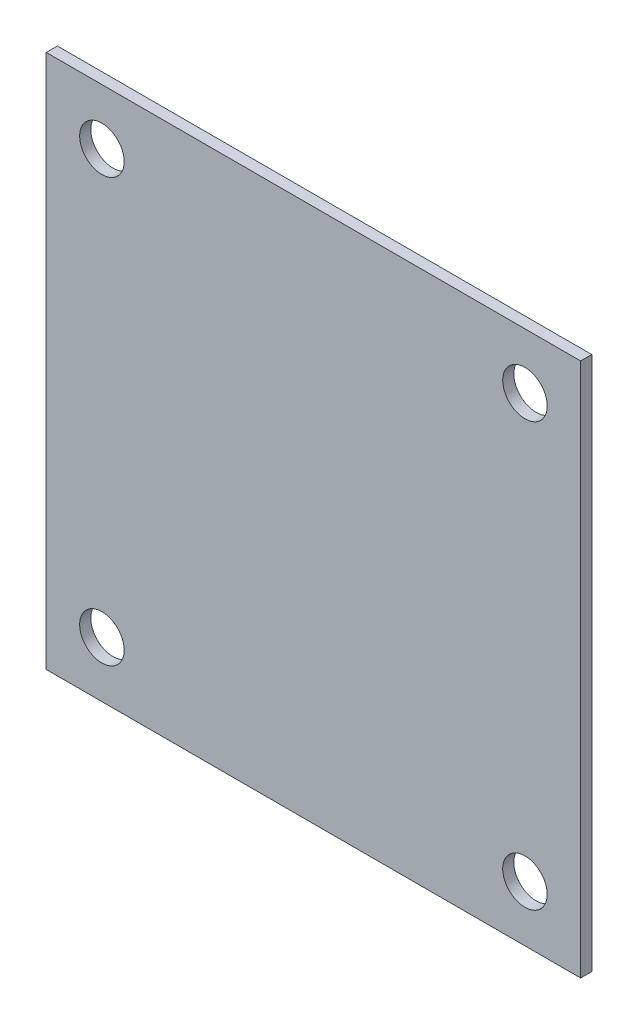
from build123d import *

# Parameters (mm, degrees)
SKETCH1_W           = 152.4
SKETCH1_H           = 152.4
SKETCH1_R           = 6.35
BOSS_EXTRUDE1_DEPTH = 3.175


with BuildPart() as part:
    # Sketch1 → Boss-Extrude1 (new body)
    with BuildSketch(Plane.XY):
        Rectangle(SKETCH1_W, SKETCH1_H)
        with Locations((-60.325, 60.325)):
            Circle(SKETCH1_R, mode=Mode.SUBTRACT)
        with Locations(Location((60.325, 60.325, 0), (0, 0, 180))):
            Circle(SKETCH1_R, mode=Mode.SUBTRACT)
        with Locations((60.325, -60.325)):
            Circle(SKETCH1_R, mode=Mode.SUBTRACT)
        with Locations(Location((-60.325, -60.325, 0), (0, 0, 180))):
            Circle(SKETCH1_R, mode=Mode.SUBTRACT)
    extrude(amount=BOSS_EXTRUDE1_DEPTH)


solid = part.part
